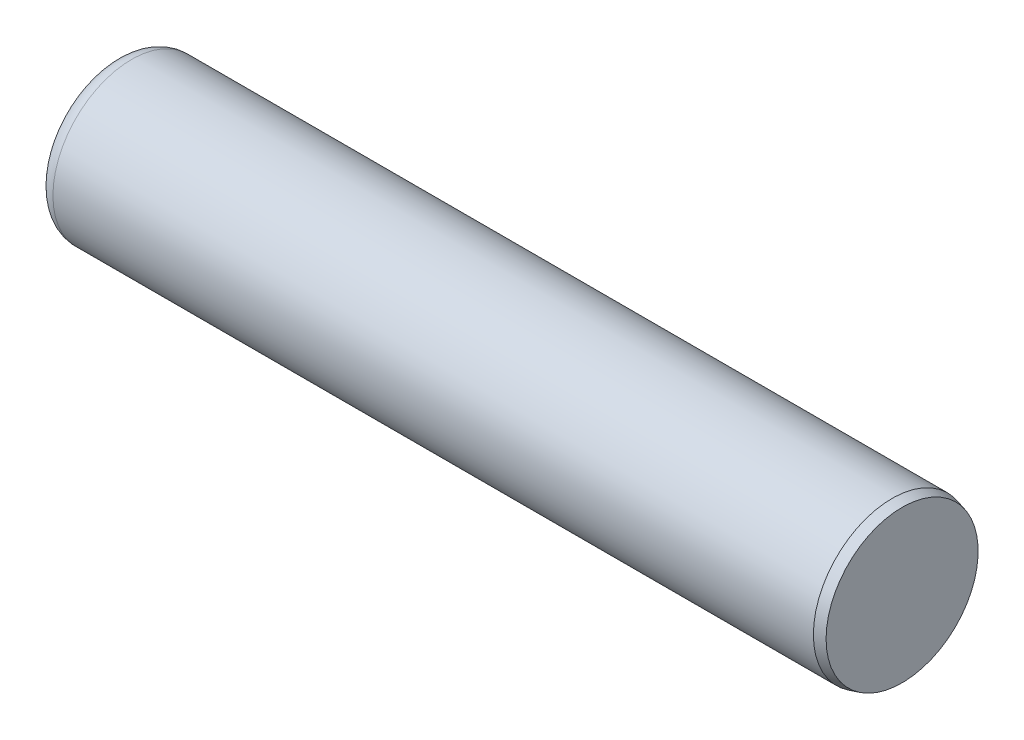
from build123d import *


with BuildPart() as part:
    # Sketch1 → Base-Revolve (revolve)
    with BuildSketch(Plane.XY, mode=Mode.PRIVATE) as base_revolve_sk:
        with BuildLine():
            Line((0, 0), (15, 0))
            Line((15, 0), (15, 1.448792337))
            Line((15, 1.448792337), (14.8088904, 1.5))
            Line((14.8088904, 1.5), (0.318516, 1.5))
            ThreePointArc((0.318516, 1.5), (0.093291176, 1.406708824), (0, 1.181484))
            Line((0, 1.181484), (0, 0))
        make_face()
    revolve(base_revolve_sk.sketch.rotate(Axis((-6.35, 0, 0), (1, 0, 0)), 90), axis=Axis((-6.35, 0, 0), (1, 0, 0)))


solid = part.part
